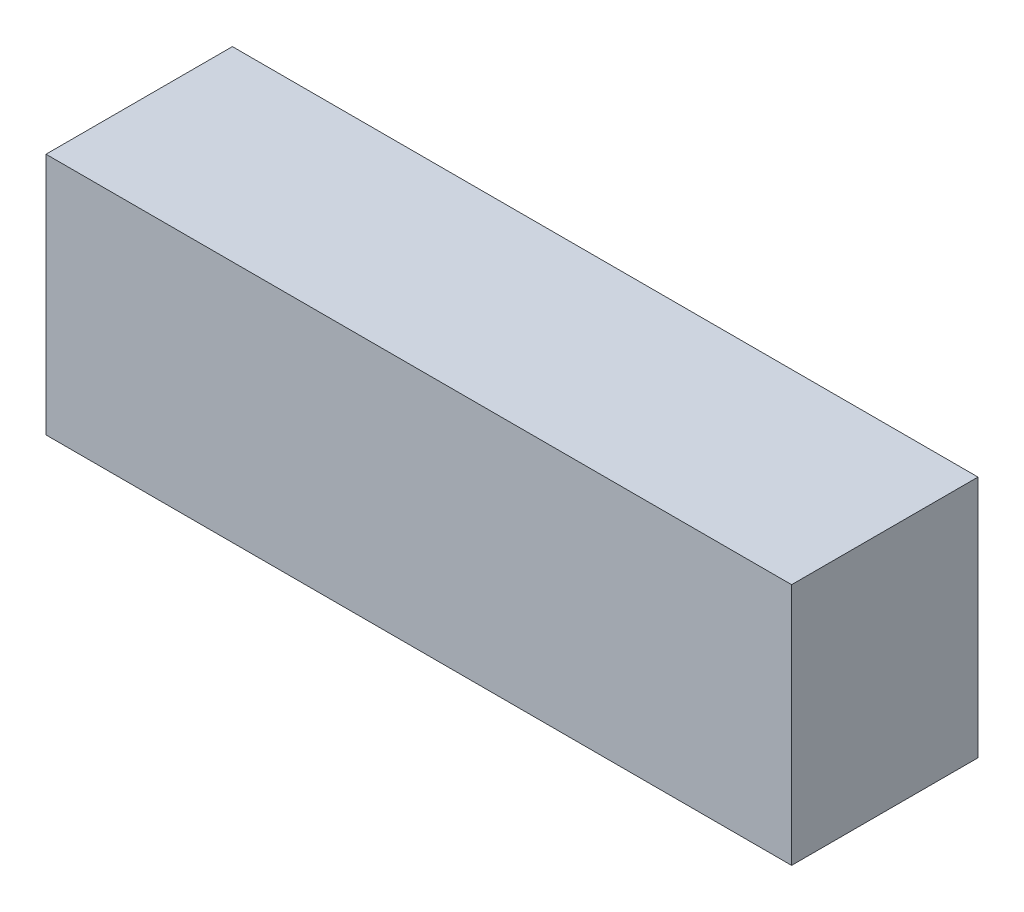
ISO-10303-21;
HEADER;
FILE_DESCRIPTION(('STEP AP214'),'2;1');
FILE_NAME('part.step','',(''),(''),'','','');
FILE_SCHEMA(('AUTOMOTIVE_DESIGN { 1 0 10303 214 1 1 1 1 }'));
ENDSEC;
DATA;
#1=APPLICATION_CONTEXT('core data for automotive mechanical design processes');
#2=APPLICATION_PROTOCOL_DEFINITION('international standard','automotive_design',2000,#1);
#3=PRODUCT_CONTEXT('',#1,'mechanical');
#4=PRODUCT('Part','Part','',(#3));
#5=PRODUCT_RELATED_PRODUCT_CATEGORY('part','',(#4));
#6=PRODUCT_DEFINITION_FORMATION('','',#4);
#7=PRODUCT_DEFINITION_CONTEXT('part definition',#1,'design');
#8=PRODUCT_DEFINITION('design','',#6,#7);
#9=PRODUCT_DEFINITION_SHAPE('','',#8);
#10=(LENGTH_UNIT() NAMED_UNIT(*) SI_UNIT(.MILLI.,.METRE.));
#11=(NAMED_UNIT(*) PLANE_ANGLE_UNIT() SI_UNIT($,.RADIAN.));
#12=(NAMED_UNIT(*) SI_UNIT($,.STERADIAN.) SOLID_ANGLE_UNIT());
#13=UNCERTAINTY_MEASURE_WITH_UNIT(LENGTH_MEASURE(1.E-05),#10,'distance_accuracy_value','');
#14=(GEOMETRIC_REPRESENTATION_CONTEXT(3) GLOBAL_UNCERTAINTY_ASSIGNED_CONTEXT((#13)) GLOBAL_UNIT_ASSIGNED_CONTEXT((#10,
#11,#12)) REPRESENTATION_CONTEXT('',''));
#15=CARTESIAN_POINT('',(0.,0.,0.));
#16=DIRECTION('',(0.,0.,1.));
#17=DIRECTION('',(1.,0.,0.));
#18=AXIS2_PLACEMENT_3D('',#15,#16,#17);
#19=CARTESIAN_POINT('',(115.,37.5,-28.75));
#20=DIRECTION('',(-1.,0.,0.));
#21=DIRECTION('',(0.,0.,1.));
#22=AXIS2_PLACEMENT_3D('',#19,#20,#21);
#23=PLANE('',#22);
#24=DIRECTION('',(0.,0.,-1.));
#25=VECTOR('',#24,1.);
#26=CARTESIAN_POINT('',(115.,-37.5,-28.75));
#27=LINE('',#26,#25);
#28=CARTESIAN_POINT('',(115.,-37.5,28.75));
#29=VERTEX_POINT('',#28);
#30=CARTESIAN_POINT('',(115.,-37.5,-28.75));
#31=VERTEX_POINT('',#30);
#32=EDGE_CURVE('E107',#29,#31,#27,.T.);
#33=ORIENTED_EDGE('',*,*,#32,.T.);
#34=DIRECTION('',(0.,-1.,0.));
#35=VECTOR('',#34,1.);
#36=CARTESIAN_POINT('',(115.,37.5,-28.75));
#37=LINE('',#36,#35);
#38=CARTESIAN_POINT('',(115.,37.5,-28.75));
#39=VERTEX_POINT('',#38);
#40=EDGE_CURVE('E11',#39,#31,#37,.T.);
#41=ORIENTED_EDGE('',*,*,#40,.F.);
#42=DIRECTION('',(0.,0.,-1.));
#43=VECTOR('',#42,1.);
#44=CARTESIAN_POINT('',(115.,37.5,-28.75));
#45=LINE('',#44,#43);
#46=CARTESIAN_POINT('',(115.,37.5,28.75));
#47=VERTEX_POINT('',#46);
#48=EDGE_CURVE('E91',#47,#39,#45,.T.);
#49=ORIENTED_EDGE('',*,*,#48,.F.);
#50=DIRECTION('',(0.,-1.,0.));
#51=VECTOR('',#50,1.);
#52=CARTESIAN_POINT('',(115.,37.5,28.75));
#53=LINE('',#52,#51);
#54=EDGE_CURVE('E103',#47,#29,#53,.T.);
#55=ORIENTED_EDGE('',*,*,#54,.T.);
#56=EDGE_LOOP('',(#33,#41,#49,#55));
#57=FACE_BOUND('',#56,.T.);
#58=ADVANCED_FACE('F39',(#57),#23,.F.);
#59=CARTESIAN_POINT('',(-115.,37.5,-28.75));
#60=DIRECTION('',(0.,0.,1.));
#61=DIRECTION('',(1.,0.,0.));
#62=AXIS2_PLACEMENT_3D('',#59,#60,#61);
#63=PLANE('',#62);
#64=DIRECTION('',(-1.,0.,0.));
#65=VECTOR('',#64,1.);
#66=CARTESIAN_POINT('',(-115.,-37.5,-28.75));
#67=LINE('',#66,#65);
#68=CARTESIAN_POINT('',(-115.,-37.5,-28.75));
#69=VERTEX_POINT('',#68);
#70=EDGE_CURVE('E96',#31,#69,#67,.T.);
#71=ORIENTED_EDGE('',*,*,#70,.T.);
#72=DIRECTION('',(0.,-1.,0.));
#73=VECTOR('',#72,1.);
#74=CARTESIAN_POINT('',(-115.,37.5,-28.75));
#75=LINE('',#74,#73);
#76=CARTESIAN_POINT('',(-115.,37.5,-28.75));
#77=VERTEX_POINT('',#76);
#78=EDGE_CURVE('E48',#77,#69,#75,.T.);
#79=ORIENTED_EDGE('',*,*,#78,.F.);
#80=DIRECTION('',(-1.,0.,0.));
#81=VECTOR('',#80,1.);
#82=CARTESIAN_POINT('',(-115.,37.5,-28.75));
#83=LINE('',#82,#81);
#84=EDGE_CURVE('E86',#39,#77,#83,.T.);
#85=ORIENTED_EDGE('',*,*,#84,.F.);
#86=ORIENTED_EDGE('',*,*,#40,.T.);
#87=EDGE_LOOP('',(#71,#79,#85,#86));
#88=FACE_BOUND('',#87,.T.);
#89=ADVANCED_FACE('F95',(#88),#63,.F.);
#90=CARTESIAN_POINT('',(-115.,37.5,-28.75));
#91=DIRECTION('',(1.,0.,0.));
#92=DIRECTION('',(0.,0.,-1.));
#93=AXIS2_PLACEMENT_3D('',#90,#91,#92);
#94=PLANE('',#93);
#95=DIRECTION('',(0.,0.,1.));
#96=VECTOR('',#95,1.);
#97=CARTESIAN_POINT('',(-115.,-37.5,-28.75));
#98=LINE('',#97,#96);
#99=CARTESIAN_POINT('',(-115.,-37.5,28.75));
#100=VERTEX_POINT('',#99);
#101=EDGE_CURVE('E73',#69,#100,#98,.T.);
#102=ORIENTED_EDGE('',*,*,#101,.T.);
#103=DIRECTION('',(0.,-1.,0.));
#104=VECTOR('',#103,1.);
#105=CARTESIAN_POINT('',(-115.,37.5,28.75));
#106=LINE('',#105,#104);
#107=CARTESIAN_POINT('',(-115.,37.5,28.75));
#108=VERTEX_POINT('',#107);
#109=EDGE_CURVE('E98',#108,#100,#106,.T.);
#110=ORIENTED_EDGE('',*,*,#109,.F.);
#111=DIRECTION('',(0.,0.,1.));
#112=VECTOR('',#111,1.);
#113=CARTESIAN_POINT('',(-115.,37.5,-28.75));
#114=LINE('',#113,#112);
#115=EDGE_CURVE('E89',#77,#108,#114,.T.);
#116=ORIENTED_EDGE('',*,*,#115,.F.);
#117=ORIENTED_EDGE('',*,*,#78,.T.);
#118=EDGE_LOOP('',(#102,#110,#116,#117));
#119=FACE_BOUND('',#118,.T.);
#120=ADVANCED_FACE('F99',(#119),#94,.F.);
#121=CARTESIAN_POINT('',(-115.,37.5,28.75));
#122=DIRECTION('',(0.,0.,-1.));
#123=DIRECTION('',(-1.,0.,0.));
#124=AXIS2_PLACEMENT_3D('',#121,#122,#123);
#125=PLANE('',#124);
#126=DIRECTION('',(1.,0.,0.));
#127=VECTOR('',#126,1.);
#128=CARTESIAN_POINT('',(-115.,-37.5,28.75));
#129=LINE('',#128,#127);
#130=EDGE_CURVE('E79',#100,#29,#129,.T.);
#131=ORIENTED_EDGE('',*,*,#130,.T.);
#132=ORIENTED_EDGE('',*,*,#54,.F.);
#133=DIRECTION('',(1.,0.,0.));
#134=VECTOR('',#133,1.);
#135=CARTESIAN_POINT('',(-115.,37.5,28.75));
#136=LINE('',#135,#134);
#137=EDGE_CURVE('E56',#108,#47,#136,.T.);
#138=ORIENTED_EDGE('',*,*,#137,.F.);
#139=ORIENTED_EDGE('',*,*,#109,.T.);
#140=EDGE_LOOP('',(#131,#132,#138,#139));
#141=FACE_BOUND('',#140,.T.);
#142=ADVANCED_FACE('F120',(#141),#125,.F.);
#143=CARTESIAN_POINT('',(0.,37.5,0.));
#144=DIRECTION('',(0.,1.,0.));
#145=DIRECTION('',(0.,0.,1.));
#146=AXIS2_PLACEMENT_3D('',#143,#144,#145);
#147=PLANE('',#146);
#148=ORIENTED_EDGE('',*,*,#48,.T.);
#149=ORIENTED_EDGE('',*,*,#84,.T.);
#150=ORIENTED_EDGE('',*,*,#115,.T.);
#151=ORIENTED_EDGE('',*,*,#137,.T.);
#152=EDGE_LOOP('',(#148,#149,#150,#151));
#153=FACE_BOUND('',#152,.T.);
#154=ADVANCED_FACE('F87',(#153),#147,.T.);
#155=CARTESIAN_POINT('',(0.,-37.5,0.));
#156=DIRECTION('',(0.,1.,0.));
#157=DIRECTION('',(0.,0.,1.));
#158=AXIS2_PLACEMENT_3D('',#155,#156,#157);
#159=PLANE('',#158);
#160=ORIENTED_EDGE('',*,*,#32,.F.);
#161=ORIENTED_EDGE('',*,*,#130,.F.);
#162=ORIENTED_EDGE('',*,*,#101,.F.);
#163=ORIENTED_EDGE('',*,*,#70,.F.);
#164=EDGE_LOOP('',(#160,#161,#162,#163));
#165=FACE_BOUND('',#164,.T.);
#166=ADVANCED_FACE('F123',(#165),#159,.F.);
#167=CLOSED_SHELL('',(#58,#89,#120,#142,#154,#166));
#168=MANIFOLD_SOLID_BREP('B2',#167);
#169=ADVANCED_BREP_SHAPE_REPRESENTATION('',(#18,#168),#14);
#170=SHAPE_DEFINITION_REPRESENTATION(#9,#169);
ENDSEC;
END-ISO-10303-21;
